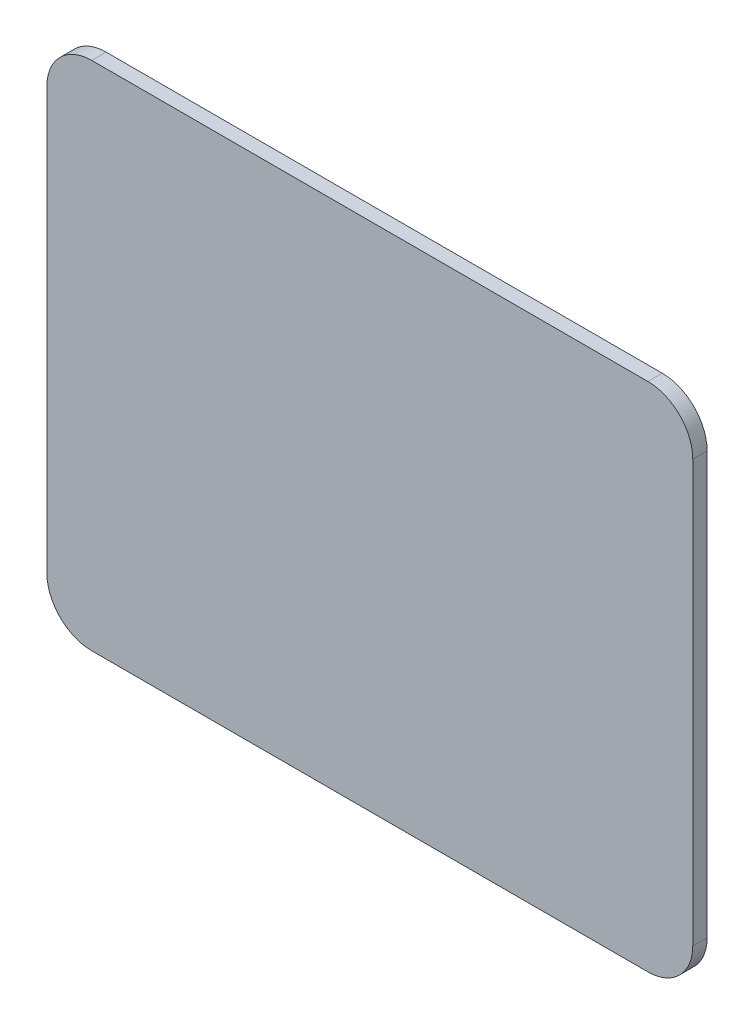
ISO-10303-21;
HEADER;
FILE_DESCRIPTION(('STEP AP214'),'2;1');
FILE_NAME('part.step','',(''),(''),'','','');
FILE_SCHEMA(('AUTOMOTIVE_DESIGN { 1 0 10303 214 1 1 1 1 }'));
ENDSEC;
DATA;
#1=APPLICATION_CONTEXT('core data for automotive mechanical design processes');
#2=APPLICATION_PROTOCOL_DEFINITION('international standard','automotive_design',2000,#1);
#3=PRODUCT_CONTEXT('',#1,'mechanical');
#4=PRODUCT('Part','Part','',(#3));
#5=PRODUCT_RELATED_PRODUCT_CATEGORY('part','',(#4));
#6=PRODUCT_DEFINITION_FORMATION('','',#4);
#7=PRODUCT_DEFINITION_CONTEXT('part definition',#1,'design');
#8=PRODUCT_DEFINITION('design','',#6,#7);
#9=PRODUCT_DEFINITION_SHAPE('','',#8);
#10=(LENGTH_UNIT() NAMED_UNIT(*) SI_UNIT(.MILLI.,.METRE.));
#11=(NAMED_UNIT(*) PLANE_ANGLE_UNIT() SI_UNIT($,.RADIAN.));
#12=(NAMED_UNIT(*) SI_UNIT($,.STERADIAN.) SOLID_ANGLE_UNIT());
#13=UNCERTAINTY_MEASURE_WITH_UNIT(LENGTH_MEASURE(1.E-05),#10,'distance_accuracy_value','');
#14=(GEOMETRIC_REPRESENTATION_CONTEXT(3) GLOBAL_UNCERTAINTY_ASSIGNED_CONTEXT((#13)) GLOBAL_UNIT_ASSIGNED_CONTEXT((#10,
#11,#12)) REPRESENTATION_CONTEXT('',''));
#15=CARTESIAN_POINT('',(0.,0.,0.));
#16=DIRECTION('',(0.,0.,1.));
#17=DIRECTION('',(1.,0.,0.));
#18=AXIS2_PLACEMENT_3D('',#15,#16,#17);
#19=CARTESIAN_POINT('',(-15.5,26.,-0.799999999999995));
#20=DIRECTION('',(0.,0.,1.));
#21=DIRECTION('',(1.,0.,0.));
#22=AXIS2_PLACEMENT_3D('',#19,#20,#21);
#23=CYLINDRICAL_SURFACE('',#22,2.49999999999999);
#24=CARTESIAN_POINT('',(-15.5,26.,0.));
#25=DIRECTION('',(0.,0.,1.));
#26=DIRECTION('',(-1.,0.,0.));
#27=AXIS2_PLACEMENT_3D('',#24,#25,#26);
#28=CIRCLE('',#27,2.49999999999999);
#29=CARTESIAN_POINT('',(-15.5,28.5,0.));
#30=VERTEX_POINT('',#29);
#31=CARTESIAN_POINT('',(-18.,26.,0.));
#32=VERTEX_POINT('',#31);
#33=EDGE_CURVE('E98',#30,#32,#28,.T.);
#34=ORIENTED_EDGE('',*,*,#33,.F.);
#35=DIRECTION('',(0.,0.,1.));
#36=VECTOR('',#35,1.);
#37=CARTESIAN_POINT('',(-15.5,28.5,-0.799999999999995));
#38=LINE('',#37,#36);
#39=CARTESIAN_POINT('',(-15.5,28.5,-0.799999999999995));
#40=VERTEX_POINT('',#39);
#41=EDGE_CURVE('E11',#40,#30,#38,.T.);
#42=ORIENTED_EDGE('',*,*,#41,.F.);
#43=CARTESIAN_POINT('',(-15.5,26.,-0.799999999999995));
#44=DIRECTION('',(0.,0.,1.));
#45=DIRECTION('',(-1.,0.,0.));
#46=AXIS2_PLACEMENT_3D('',#43,#44,#45);
#47=CIRCLE('',#46,2.49999999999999);
#48=CARTESIAN_POINT('',(-18.,26.,-0.799999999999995));
#49=VERTEX_POINT('',#48);
#50=EDGE_CURVE('E100',#40,#49,#47,.T.);
#51=ORIENTED_EDGE('',*,*,#50,.T.);
#52=DIRECTION('',(0.,0.,1.));
#53=VECTOR('',#52,1.);
#54=CARTESIAN_POINT('',(-18.,26.,-0.799999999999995));
#55=LINE('',#54,#53);
#56=EDGE_CURVE('E37',#49,#32,#55,.T.);
#57=ORIENTED_EDGE('',*,*,#56,.T.);
#58=EDGE_LOOP('',(#34,#42,#51,#57));
#59=FACE_BOUND('',#58,.T.);
#60=ADVANCED_FACE('F34',(#59),#23,.T.);
#61=CARTESIAN_POINT('',(-15.5,28.5,-0.799999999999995));
#62=DIRECTION('',(0.,1.,0.));
#63=DIRECTION('',(-1.,0.,0.));
#64=AXIS2_PLACEMENT_3D('',#61,#62,#63);
#65=PLANE('',#64);
#66=DIRECTION('',(-1.,0.,0.));
#67=VECTOR('',#66,1.);
#68=CARTESIAN_POINT('',(-15.5,28.5,0.));
#69=LINE('',#68,#67);
#70=CARTESIAN_POINT('',(15.5,28.5,0.));
#71=VERTEX_POINT('',#70);
#72=EDGE_CURVE('E116',#71,#30,#69,.T.);
#73=ORIENTED_EDGE('',*,*,#72,.F.);
#74=DIRECTION('',(0.,0.,1.));
#75=VECTOR('',#74,1.);
#76=CARTESIAN_POINT('',(15.5,28.5,-0.799999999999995));
#77=LINE('',#76,#75);
#78=CARTESIAN_POINT('',(15.5,28.5,-0.799999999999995));
#79=VERTEX_POINT('',#78);
#80=EDGE_CURVE('E42',#79,#71,#77,.T.);
#81=ORIENTED_EDGE('',*,*,#80,.F.);
#82=DIRECTION('',(-1.,0.,0.));
#83=VECTOR('',#82,1.);
#84=CARTESIAN_POINT('',(-15.5,28.5,-0.799999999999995));
#85=LINE('',#84,#83);
#86=EDGE_CURVE('E105',#79,#40,#85,.T.);
#87=ORIENTED_EDGE('',*,*,#86,.T.);
#88=ORIENTED_EDGE('',*,*,#41,.T.);
#89=EDGE_LOOP('',(#73,#81,#87,#88));
#90=FACE_BOUND('',#89,.T.);
#91=ADVANCED_FACE('F177',(#90),#65,.T.);
#92=CARTESIAN_POINT('',(15.5,26.,-0.799999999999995));
#93=DIRECTION('',(0.,0.,1.));
#94=DIRECTION('',(1.,0.,0.));
#95=AXIS2_PLACEMENT_3D('',#92,#93,#94);
#96=CYLINDRICAL_SURFACE('',#95,2.49999999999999);
#97=CARTESIAN_POINT('',(15.5,26.,0.));
#98=DIRECTION('',(0.,0.,1.));
#99=DIRECTION('',(1.,0.,0.));
#100=AXIS2_PLACEMENT_3D('',#97,#98,#99);
#101=CIRCLE('',#100,2.49999999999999);
#102=CARTESIAN_POINT('',(18.,26.,0.));
#103=VERTEX_POINT('',#102);
#104=EDGE_CURVE('E129',#103,#71,#101,.T.);
#105=ORIENTED_EDGE('',*,*,#104,.F.);
#106=DIRECTION('',(0.,0.,1.));
#107=VECTOR('',#106,1.);
#108=CARTESIAN_POINT('',(18.,26.,-0.799999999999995));
#109=LINE('',#108,#107);
#110=CARTESIAN_POINT('',(18.,26.,-0.799999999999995));
#111=VERTEX_POINT('',#110);
#112=EDGE_CURVE('E151',#111,#103,#109,.T.);
#113=ORIENTED_EDGE('',*,*,#112,.F.);
#114=CARTESIAN_POINT('',(15.5,26.,-0.799999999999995));
#115=DIRECTION('',(0.,0.,1.));
#116=DIRECTION('',(1.,0.,0.));
#117=AXIS2_PLACEMENT_3D('',#114,#115,#116);
#118=CIRCLE('',#117,2.49999999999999);
#119=EDGE_CURVE('E147',#111,#79,#118,.T.);
#120=ORIENTED_EDGE('',*,*,#119,.T.);
#121=ORIENTED_EDGE('',*,*,#80,.T.);
#122=EDGE_LOOP('',(#105,#113,#120,#121));
#123=FACE_BOUND('',#122,.T.);
#124=ADVANCED_FACE('F176',(#123),#96,.T.);
#125=CARTESIAN_POINT('',(18.,26.,-0.799999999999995));
#126=DIRECTION('',(1.,0.,0.));
#127=DIRECTION('',(0.,1.,0.));
#128=AXIS2_PLACEMENT_3D('',#125,#126,#127);
#129=PLANE('',#128);
#130=DIRECTION('',(0.,1.,0.));
#131=VECTOR('',#130,1.);
#132=CARTESIAN_POINT('',(18.,26.,0.));
#133=LINE('',#132,#131);
#134=CARTESIAN_POINT('',(18.,2.50000000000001,0.));
#135=VERTEX_POINT('',#134);
#136=EDGE_CURVE('E126',#135,#103,#133,.T.);
#137=ORIENTED_EDGE('',*,*,#136,.F.);
#138=DIRECTION('',(0.,0.,1.));
#139=VECTOR('',#138,1.);
#140=CARTESIAN_POINT('',(18.,2.50000000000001,-0.799999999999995));
#141=LINE('',#140,#139);
#142=CARTESIAN_POINT('',(18.,2.50000000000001,-0.799999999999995));
#143=VERTEX_POINT('',#142);
#144=EDGE_CURVE('E153',#143,#135,#141,.T.);
#145=ORIENTED_EDGE('',*,*,#144,.F.);
#146=DIRECTION('',(0.,1.,0.));
#147=VECTOR('',#146,1.);
#148=CARTESIAN_POINT('',(18.,26.,-0.799999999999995));
#149=LINE('',#148,#147);
#150=EDGE_CURVE('E144',#143,#111,#149,.T.);
#151=ORIENTED_EDGE('',*,*,#150,.T.);
#152=ORIENTED_EDGE('',*,*,#112,.T.);
#153=EDGE_LOOP('',(#137,#145,#151,#152));
#154=FACE_BOUND('',#153,.T.);
#155=ADVANCED_FACE('F172',(#154),#129,.T.);
#156=CARTESIAN_POINT('',(15.5,2.5,-0.799999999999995));
#157=DIRECTION('',(0.,0.,1.));
#158=DIRECTION('',(1.,0.,0.));
#159=AXIS2_PLACEMENT_3D('',#156,#157,#158);
#160=CYLINDRICAL_SURFACE('',#159,2.5);
#161=CARTESIAN_POINT('',(15.5,2.5,0.));
#162=DIRECTION('',(0.,0.,1.));
#163=DIRECTION('',(-1.,0.,0.));
#164=AXIS2_PLACEMENT_3D('',#161,#162,#163);
#165=CIRCLE('',#164,2.5);
#166=CARTESIAN_POINT('',(15.5,0.,0.));
#167=VERTEX_POINT('',#166);
#168=EDGE_CURVE('E123',#167,#135,#165,.T.);
#169=ORIENTED_EDGE('',*,*,#168,.F.);
#170=DIRECTION('',(0.,0.,1.));
#171=VECTOR('',#170,1.);
#172=CARTESIAN_POINT('',(15.5,0.,-0.799999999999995));
#173=LINE('',#172,#171);
#174=CARTESIAN_POINT('',(15.5,0.,-0.799999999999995));
#175=VERTEX_POINT('',#174);
#176=EDGE_CURVE('E155',#175,#167,#173,.T.);
#177=ORIENTED_EDGE('',*,*,#176,.F.);
#178=CARTESIAN_POINT('',(15.5,2.5,-0.799999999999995));
#179=DIRECTION('',(0.,0.,1.));
#180=DIRECTION('',(-1.,0.,0.));
#181=AXIS2_PLACEMENT_3D('',#178,#179,#180);
#182=CIRCLE('',#181,2.5);
#183=EDGE_CURVE('E141',#175,#143,#182,.T.);
#184=ORIENTED_EDGE('',*,*,#183,.T.);
#185=ORIENTED_EDGE('',*,*,#144,.T.);
#186=EDGE_LOOP('',(#169,#177,#184,#185));
#187=FACE_BOUND('',#186,.T.);
#188=ADVANCED_FACE('F168',(#187),#160,.T.);
#189=CARTESIAN_POINT('',(-15.5,0.,-0.799999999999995));
#190=DIRECTION('',(0.,-1.,0.));
#191=DIRECTION('',(1.,0.,0.));
#192=AXIS2_PLACEMENT_3D('',#189,#190,#191);
#193=PLANE('',#192);
#194=DIRECTION('',(1.,0.,0.));
#195=VECTOR('',#194,1.);
#196=CARTESIAN_POINT('',(-15.5,0.,0.));
#197=LINE('',#196,#195);
#198=CARTESIAN_POINT('',(-15.5,0.,0.));
#199=VERTEX_POINT('',#198);
#200=EDGE_CURVE('E120',#199,#167,#197,.T.);
#201=ORIENTED_EDGE('',*,*,#200,.F.);
#202=DIRECTION('',(0.,0.,1.));
#203=VECTOR('',#202,1.);
#204=CARTESIAN_POINT('',(-15.5,0.,-0.799999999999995));
#205=LINE('',#204,#203);
#206=CARTESIAN_POINT('',(-15.5,0.,-0.799999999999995));
#207=VERTEX_POINT('',#206);
#208=EDGE_CURVE('E157',#207,#199,#205,.T.);
#209=ORIENTED_EDGE('',*,*,#208,.F.);
#210=DIRECTION('',(1.,0.,0.));
#211=VECTOR('',#210,1.);
#212=CARTESIAN_POINT('',(-15.5,0.,-0.799999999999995));
#213=LINE('',#212,#211);
#214=EDGE_CURVE('E138',#207,#175,#213,.T.);
#215=ORIENTED_EDGE('',*,*,#214,.T.);
#216=ORIENTED_EDGE('',*,*,#176,.T.);
#217=EDGE_LOOP('',(#201,#209,#215,#216));
#218=FACE_BOUND('',#217,.T.);
#219=ADVANCED_FACE('F164',(#218),#193,.T.);
#220=CARTESIAN_POINT('',(-15.5,2.5,-0.799999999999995));
#221=DIRECTION('',(0.,0.,1.));
#222=DIRECTION('',(1.,0.,0.));
#223=AXIS2_PLACEMENT_3D('',#220,#221,#222);
#224=CYLINDRICAL_SURFACE('',#223,2.5);
#225=CARTESIAN_POINT('',(-15.5,2.5,0.));
#226=DIRECTION('',(0.,0.,1.));
#227=DIRECTION('',(-1.,0.,0.));
#228=AXIS2_PLACEMENT_3D('',#225,#226,#227);
#229=CIRCLE('',#228,2.5);
#230=CARTESIAN_POINT('',(-18.,2.5,0.));
#231=VERTEX_POINT('',#230);
#232=EDGE_CURVE('E112',#231,#199,#229,.T.);
#233=ORIENTED_EDGE('',*,*,#232,.F.);
#234=DIRECTION('',(0.,0.,1.));
#235=VECTOR('',#234,1.);
#236=CARTESIAN_POINT('',(-18.,2.5,-0.799999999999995));
#237=LINE('',#236,#235);
#238=CARTESIAN_POINT('',(-18.,2.5,-0.799999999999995));
#239=VERTEX_POINT('',#238);
#240=EDGE_CURVE('E104',#239,#231,#237,.T.);
#241=ORIENTED_EDGE('',*,*,#240,.F.);
#242=CARTESIAN_POINT('',(-15.5,2.5,-0.799999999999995));
#243=DIRECTION('',(0.,0.,1.));
#244=DIRECTION('',(-1.,0.,0.));
#245=AXIS2_PLACEMENT_3D('',#242,#243,#244);
#246=CIRCLE('',#245,2.5);
#247=EDGE_CURVE('E135',#239,#207,#246,.T.);
#248=ORIENTED_EDGE('',*,*,#247,.T.);
#249=ORIENTED_EDGE('',*,*,#208,.T.);
#250=EDGE_LOOP('',(#233,#241,#248,#249));
#251=FACE_BOUND('',#250,.T.);
#252=ADVANCED_FACE('F160',(#251),#224,.T.);
#253=CARTESIAN_POINT('',(-18.,26.,-0.799999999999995));
#254=DIRECTION('',(-1.,0.,0.));
#255=DIRECTION('',(0.,-1.,0.));
#256=AXIS2_PLACEMENT_3D('',#253,#254,#255);
#257=PLANE('',#256);
#258=DIRECTION('',(0.,-1.,0.));
#259=VECTOR('',#258,1.);
#260=CARTESIAN_POINT('',(-18.,26.,0.));
#261=LINE('',#260,#259);
#262=EDGE_CURVE('E107',#32,#231,#261,.T.);
#263=ORIENTED_EDGE('',*,*,#262,.F.);
#264=ORIENTED_EDGE('',*,*,#56,.F.);
#265=DIRECTION('',(0.,-1.,0.));
#266=VECTOR('',#265,1.);
#267=CARTESIAN_POINT('',(-18.,26.,-0.799999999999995));
#268=LINE('',#267,#266);
#269=EDGE_CURVE('E133',#49,#239,#268,.T.);
#270=ORIENTED_EDGE('',*,*,#269,.T.);
#271=ORIENTED_EDGE('',*,*,#240,.T.);
#272=EDGE_LOOP('',(#263,#264,#270,#271));
#273=FACE_BOUND('',#272,.T.);
#274=ADVANCED_FACE('F108',(#273),#257,.T.);
#275=CARTESIAN_POINT('',(-15.5,26.,-0.799999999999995));
#276=DIRECTION('',(0.,0.,-1.));
#277=DIRECTION('',(-1.,0.,0.));
#278=AXIS2_PLACEMENT_3D('',#275,#276,#277);
#279=PLANE('',#278);
#280=ORIENTED_EDGE('',*,*,#50,.F.);
#281=ORIENTED_EDGE('',*,*,#86,.F.);
#282=ORIENTED_EDGE('',*,*,#119,.F.);
#283=ORIENTED_EDGE('',*,*,#150,.F.);
#284=ORIENTED_EDGE('',*,*,#183,.F.);
#285=ORIENTED_EDGE('',*,*,#214,.F.);
#286=ORIENTED_EDGE('',*,*,#247,.F.);
#287=ORIENTED_EDGE('',*,*,#269,.F.);
#288=EDGE_LOOP('',(#280,#281,#282,#283,#284,#285,#286,#287));
#289=FACE_BOUND('',#288,.T.);
#290=ADVANCED_FACE('F180',(#289),#279,.T.);
#291=CARTESIAN_POINT('',(-15.5,26.,0.));
#292=DIRECTION('',(0.,0.,-1.));
#293=DIRECTION('',(-1.,0.,0.));
#294=AXIS2_PLACEMENT_3D('',#291,#292,#293);
#295=PLANE('',#294);
#296=ORIENTED_EDGE('',*,*,#33,.T.);
#297=ORIENTED_EDGE('',*,*,#262,.T.);
#298=ORIENTED_EDGE('',*,*,#232,.T.);
#299=ORIENTED_EDGE('',*,*,#200,.T.);
#300=ORIENTED_EDGE('',*,*,#168,.T.);
#301=ORIENTED_EDGE('',*,*,#136,.T.);
#302=ORIENTED_EDGE('',*,*,#104,.T.);
#303=ORIENTED_EDGE('',*,*,#72,.T.);
#304=EDGE_LOOP('',(#296,#297,#298,#299,#300,#301,#302,#303));
#305=FACE_BOUND('',#304,.T.);
#306=ADVANCED_FACE('F114',(#305),#295,.F.);
#307=CLOSED_SHELL('',(#60,#91,#124,#155,#188,#219,#252,#274,#290,#306));
#308=MANIFOLD_SOLID_BREP('B2',#307);
#309=ADVANCED_BREP_SHAPE_REPRESENTATION('',(#18,#308),#14);
#310=SHAPE_DEFINITION_REPRESENTATION(#9,#309);
ENDSEC;
END-ISO-10303-21;
